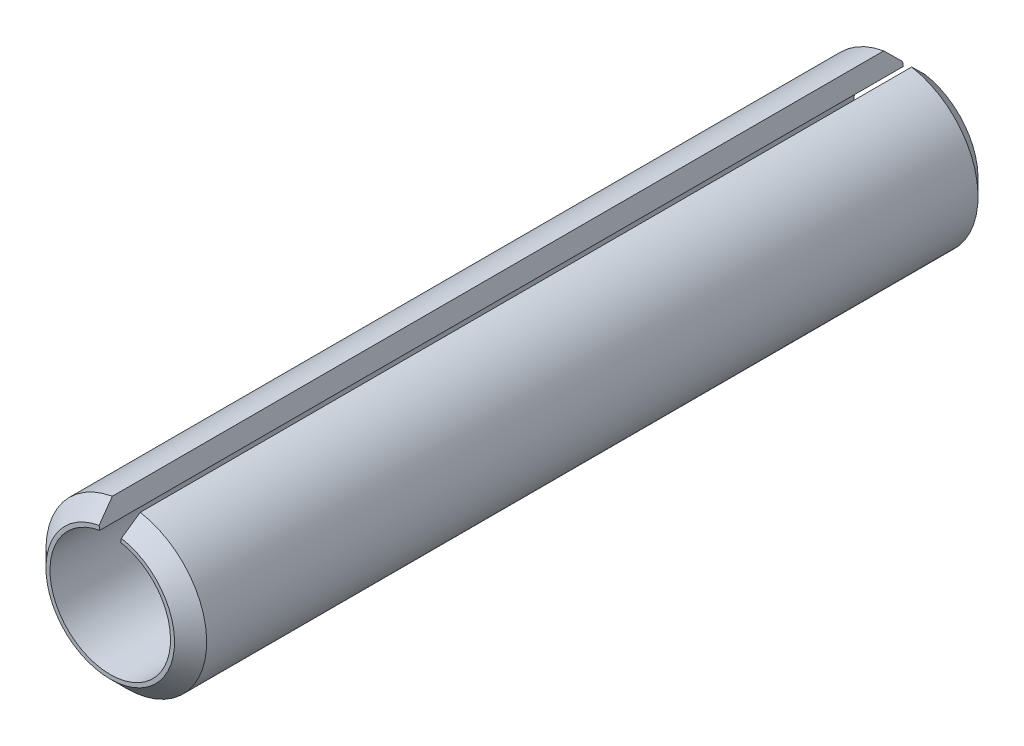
from build123d import *

# Parameters (mm, degrees)
BASE_EXTRUSION_DEPTH = 10
CHANFREIN1_SIZE      = 0.4


with BuildPart() as part:
    # Esquisse1 → Base-Extrusion (new, symmetric)
    with BuildSketch(Plane.XY):
        with BuildLine():
            Line((-0.260472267, 1.47721163), (-0.347296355, 1.969615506))
            ThreePointArc((-0.347296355, 1.969615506), (0, -2), (0.347296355, 1.969615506))
            Line((0.347296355, 1.969615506), (0.260472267, 1.47721163))
            ThreePointArc((0.260472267, 1.47721163), (0, -1.5), (-0.260472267, 1.47721163))
        make_face()
    extrude(amount=BASE_EXTRUSION_DEPTH, both=True)

    # Chanfrein1
    chanfrein1_edges = [part.edges().sort_by_distance(p)[0] for p in [
        (0, -2, -10),
        (0, -2, 10),
    ]]
    chamfer(chanfrein1_edges, length=CHANFREIN1_SIZE)


solid = part.part
